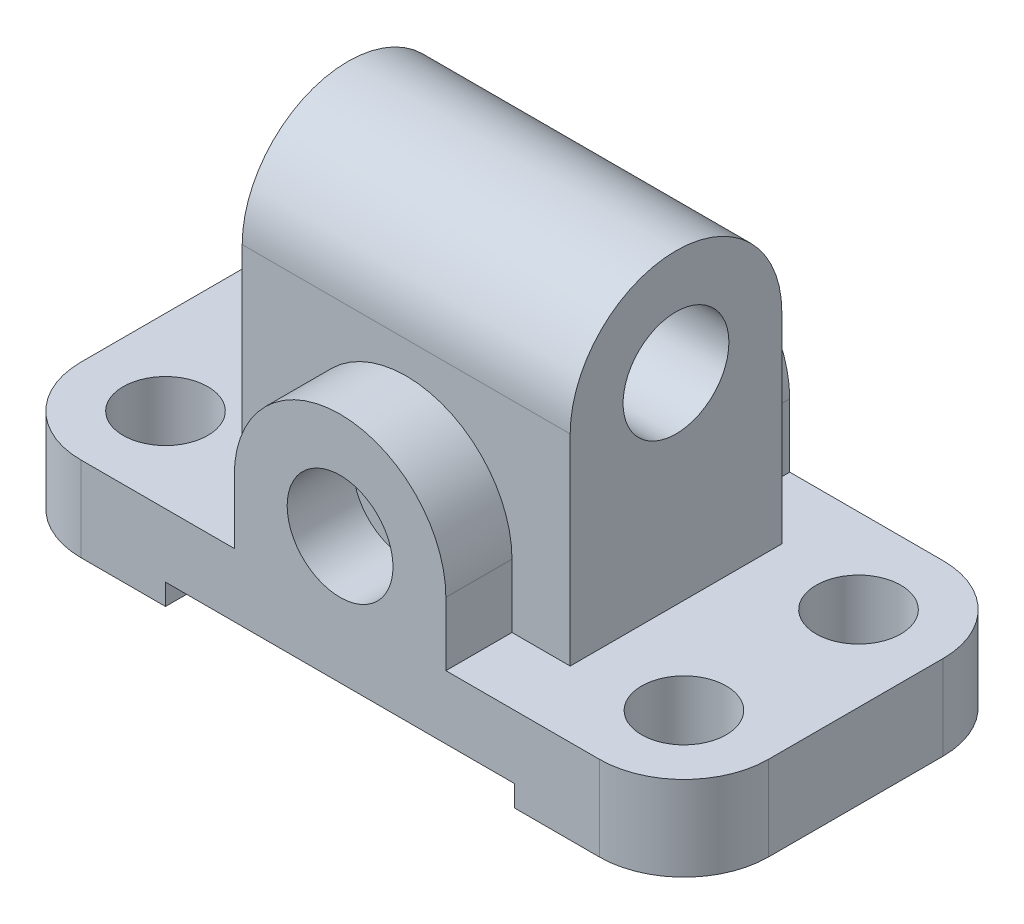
ISO-10303-21;
HEADER;
FILE_DESCRIPTION(('STEP AP214'),'2;1');
FILE_NAME('part.step','',(''),(''),'','','');
FILE_SCHEMA(('AUTOMOTIVE_DESIGN { 1 0 10303 214 1 1 1 1 }'));
ENDSEC;
DATA;
#1=APPLICATION_CONTEXT('core data for automotive mechanical design processes');
#2=APPLICATION_PROTOCOL_DEFINITION('international standard','automotive_design',2000,#1);
#3=PRODUCT_CONTEXT('',#1,'mechanical');
#4=PRODUCT('Part','Part','',(#3));
#5=PRODUCT_RELATED_PRODUCT_CATEGORY('part','',(#4));
#6=PRODUCT_DEFINITION_FORMATION('','',#4);
#7=PRODUCT_DEFINITION_CONTEXT('part definition',#1,'design');
#8=PRODUCT_DEFINITION('design','',#6,#7);
#9=PRODUCT_DEFINITION_SHAPE('','',#8);
#10=(LENGTH_UNIT() NAMED_UNIT(*) SI_UNIT(.MILLI.,.METRE.));
#11=(NAMED_UNIT(*) PLANE_ANGLE_UNIT() SI_UNIT($,.RADIAN.));
#12=(NAMED_UNIT(*) SI_UNIT($,.STERADIAN.) SOLID_ANGLE_UNIT());
#13=UNCERTAINTY_MEASURE_WITH_UNIT(LENGTH_MEASURE(1.E-05),#10,'distance_accuracy_value','');
#14=(GEOMETRIC_REPRESENTATION_CONTEXT(3) GLOBAL_UNCERTAINTY_ASSIGNED_CONTEXT((#13)) GLOBAL_UNIT_ASSIGNED_CONTEXT((#10,
#11,#12)) REPRESENTATION_CONTEXT('',''));
#15=CARTESIAN_POINT('',(0.,0.,0.));
#16=DIRECTION('',(0.,0.,1.));
#17=DIRECTION('',(1.,0.,0.));
#18=AXIS2_PLACEMENT_3D('',#15,#16,#17);
#19=CARTESIAN_POINT('',(-98.,0.,-33.));
#20=DIRECTION('',(0.,1.,0.));
#21=DIRECTION('',(0.,0.,1.));
#22=AXIS2_PLACEMENT_3D('',#19,#20,#21);
#23=PLANE('',#22);
#24=CARTESIAN_POINT('',(-98.,0.,-33.));
#25=DIRECTION('',(0.,1.,0.));
#26=DIRECTION('',(0.,0.,1.));
#27=AXIS2_PLACEMENT_3D('',#24,#25,#26);
#28=CIRCLE('',#27,16.);
#29=CARTESIAN_POINT('',(-98.,0.,-17.));
#30=VERTEX_POINT('',#29);
#31=EDGE_CURVE('E269',#30,#30,#28,.T.);
#32=ORIENTED_EDGE('',*,*,#31,.T.);
#33=EDGE_LOOP('',(#32));
#34=FACE_BOUND('',#33,.T.);
#35=CARTESIAN_POINT('',(-98.,0.,33.));
#36=DIRECTION('',(0.,-1.,0.));
#37=DIRECTION('',(0.,0.,-1.));
#38=AXIS2_PLACEMENT_3D('',#35,#36,#37);
#39=CIRCLE('',#38,16.);
#40=CARTESIAN_POINT('',(-98.,0.,17.));
#41=VERTEX_POINT('',#40);
#42=EDGE_CURVE('E263',#41,#41,#39,.T.);
#43=ORIENTED_EDGE('',*,*,#42,.F.);
#44=EDGE_LOOP('',(#43));
#45=FACE_BOUND('',#44,.T.);
#46=DIRECTION('',(-1.,0.,0.));
#47=VECTOR('',#46,1.);
#48=CARTESIAN_POINT('',(98.,0.,-65.));
#49=LINE('',#48,#47);
#50=CARTESIAN_POINT('',(-66.,0.,-65.));
#51=VERTEX_POINT('',#50);
#52=CARTESIAN_POINT('',(-98.,0.,-65.));
#53=VERTEX_POINT('',#52);
#54=EDGE_CURVE('E383',#51,#53,#49,.T.);
#55=ORIENTED_EDGE('',*,*,#54,.F.);
#56=DIRECTION('',(0.,0.,1.));
#57=VECTOR('',#56,1.);
#58=CARTESIAN_POINT('',(-66.,0.,-33.));
#59=LINE('',#58,#57);
#60=CARTESIAN_POINT('',(-66.,0.,65.));
#61=VERTEX_POINT('',#60);
#62=EDGE_CURVE('E206',#51,#61,#59,.T.);
#63=ORIENTED_EDGE('',*,*,#62,.T.);
#64=DIRECTION('',(1.,0.,0.));
#65=VECTOR('',#64,1.);
#66=CARTESIAN_POINT('',(98.,0.,64.9999999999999));
#67=LINE('',#66,#65);
#68=CARTESIAN_POINT('',(-98.,0.,65.));
#69=VERTEX_POINT('',#68);
#70=EDGE_CURVE('E374',#69,#61,#67,.T.);
#71=ORIENTED_EDGE('',*,*,#70,.F.);
#72=CARTESIAN_POINT('',(-98.,0.,33.));
#73=DIRECTION('',(0.,1.,0.));
#74=DIRECTION('',(0.,0.,-1.));
#75=AXIS2_PLACEMENT_3D('',#72,#73,#74);
#76=CIRCLE('',#75,32.);
#77=CARTESIAN_POINT('',(-130.,0.,33.));
#78=VERTEX_POINT('',#77);
#79=EDGE_CURVE('E371',#78,#69,#76,.T.);
#80=ORIENTED_EDGE('',*,*,#79,.F.);
#81=DIRECTION('',(0.,0.,1.));
#82=VECTOR('',#81,1.);
#83=CARTESIAN_POINT('',(-130.,0.,33.));
#84=LINE('',#83,#82);
#85=CARTESIAN_POINT('',(-130.,0.,-33.));
#86=VERTEX_POINT('',#85);
#87=EDGE_CURVE('E369',#86,#78,#84,.T.);
#88=ORIENTED_EDGE('',*,*,#87,.F.);
#89=CARTESIAN_POINT('',(-98.,0.,-33.));
#90=DIRECTION('',(0.,1.,0.));
#91=DIRECTION('',(0.,0.,1.));
#92=AXIS2_PLACEMENT_3D('',#89,#90,#91);
#93=CIRCLE('',#92,32.);
#94=EDGE_CURVE('E335',#53,#86,#93,.T.);
#95=ORIENTED_EDGE('',*,*,#94,.F.);
#96=EDGE_LOOP('',(#55,#63,#71,#80,#88,#95));
#97=FACE_BOUND('',#96,.T.);
#98=ADVANCED_FACE('F31',(#34,#45,#97),#23,.F.);
#99=CARTESIAN_POINT('',(-98.,32.,-33.));
#100=DIRECTION('',(0.,1.,0.));
#101=DIRECTION('',(0.,0.,1.));
#102=AXIS2_PLACEMENT_3D('',#99,#100,#101);
#103=PLANE('',#102);
#104=CARTESIAN_POINT('',(98.,32.,-33.));
#105=DIRECTION('',(0.,-1.,0.));
#106=DIRECTION('',(0.,0.,1.));
#107=AXIS2_PLACEMENT_3D('',#104,#105,#106);
#108=CIRCLE('',#107,16.);
#109=CARTESIAN_POINT('',(98.,32.,-17.));
#110=VERTEX_POINT('',#109);
#111=EDGE_CURVE('E250',#110,#110,#108,.T.);
#112=ORIENTED_EDGE('',*,*,#111,.T.);
#113=EDGE_LOOP('',(#112));
#114=FACE_BOUND('',#113,.T.);
#115=CARTESIAN_POINT('',(98.,32.,33.));
#116=DIRECTION('',(0.,1.,0.));
#117=DIRECTION('',(0.,0.,-1.));
#118=AXIS2_PLACEMENT_3D('',#115,#116,#117);
#119=CIRCLE('',#118,16.);
#120=CARTESIAN_POINT('',(98.,32.,17.));
#121=VERTEX_POINT('',#120);
#122=EDGE_CURVE('E254',#121,#121,#119,.T.);
#123=ORIENTED_EDGE('',*,*,#122,.F.);
#124=EDGE_LOOP('',(#123));
#125=FACE_BOUND('',#124,.T.);
#126=DIRECTION('',(1.,0.,0.));
#127=VECTOR('',#126,1.);
#128=CARTESIAN_POINT('',(-62.,32.,40.));
#129=LINE('',#128,#127);
#130=CARTESIAN_POINT('',(40.,32.,40.));
#131=VERTEX_POINT('',#130);
#132=CARTESIAN_POINT('',(62.,32.,40.));
#133=VERTEX_POINT('',#132);
#134=EDGE_CURVE('E340',#131,#133,#129,.T.);
#135=ORIENTED_EDGE('',*,*,#134,.F.);
#136=DIRECTION('',(0.,0.,-1.));
#137=VECTOR('',#136,1.);
#138=CARTESIAN_POINT('',(40.,32.,167.449987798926));
#139=LINE('',#138,#137);
#140=CARTESIAN_POINT('',(40.,32.,65.));
#141=VERTEX_POINT('',#140);
#142=EDGE_CURVE('E236',#141,#131,#139,.T.);
#143=ORIENTED_EDGE('',*,*,#142,.F.);
#144=DIRECTION('',(1.,0.,0.));
#145=VECTOR('',#144,1.);
#146=CARTESIAN_POINT('',(98.,32.,64.9999999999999));
#147=LINE('',#146,#145);
#148=CARTESIAN_POINT('',(98.,32.,64.9999999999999));
#149=VERTEX_POINT('',#148);
#150=EDGE_CURVE('E352',#141,#149,#147,.T.);
#151=ORIENTED_EDGE('',*,*,#150,.T.);
#152=CARTESIAN_POINT('',(98.,32.,33.));
#153=DIRECTION('',(0.,1.,0.));
#154=DIRECTION('',(0.,0.,1.));
#155=AXIS2_PLACEMENT_3D('',#152,#153,#154);
#156=CIRCLE('',#155,32.);
#157=CARTESIAN_POINT('',(130.,32.,33.));
#158=VERTEX_POINT('',#157);
#159=EDGE_CURVE('E356',#149,#158,#156,.T.);
#160=ORIENTED_EDGE('',*,*,#159,.T.);
#161=DIRECTION('',(0.,0.,-1.));
#162=VECTOR('',#161,1.);
#163=CARTESIAN_POINT('',(130.,32.,33.));
#164=LINE('',#163,#162);
#165=CARTESIAN_POINT('',(130.,32.,-33.));
#166=VERTEX_POINT('',#165);
#167=EDGE_CURVE('E358',#158,#166,#164,.T.);
#168=ORIENTED_EDGE('',*,*,#167,.T.);
#169=CARTESIAN_POINT('',(98.,32.,-33.));
#170=DIRECTION('',(0.,1.,0.));
#171=DIRECTION('',(0.,0.,1.));
#172=AXIS2_PLACEMENT_3D('',#169,#170,#171);
#173=CIRCLE('',#172,32.);
#174=CARTESIAN_POINT('',(98.,32.,-65.));
#175=VERTEX_POINT('',#174);
#176=EDGE_CURVE('E360',#166,#175,#173,.T.);
#177=ORIENTED_EDGE('',*,*,#176,.T.);
#178=DIRECTION('',(-1.,0.,0.));
#179=VECTOR('',#178,1.);
#180=CARTESIAN_POINT('',(98.,32.,-65.));
#181=LINE('',#180,#179);
#182=CARTESIAN_POINT('',(40.,32.,-65.));
#183=VERTEX_POINT('',#182);
#184=EDGE_CURVE('E363',#175,#183,#181,.T.);
#185=ORIENTED_EDGE('',*,*,#184,.T.);
#186=DIRECTION('',(0.,0.,1.));
#187=VECTOR('',#186,1.);
#188=CARTESIAN_POINT('',(40.,32.,-167.449987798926));
#189=LINE('',#188,#187);
#190=CARTESIAN_POINT('',(40.,32.,-40.));
#191=VERTEX_POINT('',#190);
#192=EDGE_CURVE('E272',#183,#191,#189,.T.);
#193=ORIENTED_EDGE('',*,*,#192,.T.);
#194=DIRECTION('',(1.,0.,0.));
#195=VECTOR('',#194,1.);
#196=CARTESIAN_POINT('',(-62.,32.,-40.));
#197=LINE('',#196,#195);
#198=CARTESIAN_POINT('',(62.,32.,-40.));
#199=VERTEX_POINT('',#198);
#200=EDGE_CURVE('E336',#191,#199,#197,.T.);
#201=ORIENTED_EDGE('',*,*,#200,.T.);
#202=DIRECTION('',(0.,0.,-1.));
#203=VECTOR('',#202,1.);
#204=CARTESIAN_POINT('',(62.,32.,-40.));
#205=LINE('',#204,#203);
#206=EDGE_CURVE('E314',#133,#199,#205,.T.);
#207=ORIENTED_EDGE('',*,*,#206,.F.);
#208=EDGE_LOOP('',(#135,#143,#151,#160,#168,#177,#185,#193,#201,#207));
#209=FACE_BOUND('',#208,.T.);
#210=ADVANCED_FACE('F435',(#114,#125,#209),#103,.T.);
#211=CARTESIAN_POINT('',(-98.,32.,-33.));
#212=DIRECTION('',(0.,1.,0.));
#213=DIRECTION('',(0.,0.,1.));
#214=AXIS2_PLACEMENT_3D('',#211,#212,#213);
#215=CIRCLE('',#214,16.);
#216=CARTESIAN_POINT('',(-98.,32.,-17.));
#217=VERTEX_POINT('',#216);
#218=EDGE_CURVE('E266',#217,#217,#215,.T.);
#219=ORIENTED_EDGE('',*,*,#218,.F.);
#220=EDGE_LOOP('',(#219));
#221=FACE_BOUND('',#220,.T.);
#222=CARTESIAN_POINT('',(-98.,32.,33.));
#223=DIRECTION('',(0.,-1.,0.));
#224=DIRECTION('',(0.,0.,-1.));
#225=AXIS2_PLACEMENT_3D('',#222,#223,#224);
#226=CIRCLE('',#225,16.);
#227=CARTESIAN_POINT('',(-98.,32.,17.));
#228=VERTEX_POINT('',#227);
#229=EDGE_CURVE('E260',#228,#228,#226,.T.);
#230=ORIENTED_EDGE('',*,*,#229,.T.);
#231=EDGE_LOOP('',(#230));
#232=FACE_BOUND('',#231,.T.);
#233=CARTESIAN_POINT('',(-98.,32.,65.));
#234=VERTEX_POINT('',#233);
#235=CARTESIAN_POINT('',(-40.,32.,65.));
#236=VERTEX_POINT('',#235);
#237=EDGE_CURVE('E353',#234,#236,#147,.T.);
#238=ORIENTED_EDGE('',*,*,#237,.T.);
#239=DIRECTION('',(0.,0.,-1.));
#240=VECTOR('',#239,1.);
#241=CARTESIAN_POINT('',(-40.,32.,167.449987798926));
#242=LINE('',#241,#240);
#243=CARTESIAN_POINT('',(-40.,32.,40.));
#244=VERTEX_POINT('',#243);
#245=EDGE_CURVE('E224',#236,#244,#242,.T.);
#246=ORIENTED_EDGE('',*,*,#245,.T.);
#247=CARTESIAN_POINT('',(-62.,32.,40.));
#248=VERTEX_POINT('',#247);
#249=EDGE_CURVE('E337',#248,#244,#129,.T.);
#250=ORIENTED_EDGE('',*,*,#249,.F.);
#251=DIRECTION('',(0.,0.,-1.));
#252=VECTOR('',#251,1.);
#253=CARTESIAN_POINT('',(-62.,32.,-40.));
#254=LINE('',#253,#252);
#255=CARTESIAN_POINT('',(-62.,32.,-40.));
#256=VERTEX_POINT('',#255);
#257=EDGE_CURVE('E328',#248,#256,#254,.T.);
#258=ORIENTED_EDGE('',*,*,#257,.T.);
#259=CARTESIAN_POINT('',(-40.,32.,-40.));
#260=VERTEX_POINT('',#259);
#261=EDGE_CURVE('E332',#256,#260,#197,.T.);
#262=ORIENTED_EDGE('',*,*,#261,.T.);
#263=DIRECTION('',(0.,0.,1.));
#264=VECTOR('',#263,1.);
#265=CARTESIAN_POINT('',(-40.,32.,-167.449987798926));
#266=LINE('',#265,#264);
#267=CARTESIAN_POINT('',(-40.,32.,-65.));
#268=VERTEX_POINT('',#267);
#269=EDGE_CURVE('E287',#268,#260,#266,.T.);
#270=ORIENTED_EDGE('',*,*,#269,.F.);
#271=CARTESIAN_POINT('',(-98.,32.,-65.));
#272=VERTEX_POINT('',#271);
#273=EDGE_CURVE('E362',#268,#272,#181,.T.);
#274=ORIENTED_EDGE('',*,*,#273,.T.);
#275=CARTESIAN_POINT('',(-98.,32.,-33.));
#276=DIRECTION('',(0.,1.,0.));
#277=DIRECTION('',(0.,0.,1.));
#278=AXIS2_PLACEMENT_3D('',#275,#276,#277);
#279=CIRCLE('',#278,32.);
#280=CARTESIAN_POINT('',(-130.,32.,-33.));
#281=VERTEX_POINT('',#280);
#282=EDGE_CURVE('E344',#272,#281,#279,.T.);
#283=ORIENTED_EDGE('',*,*,#282,.T.);
#284=DIRECTION('',(0.,0.,1.));
#285=VECTOR('',#284,1.);
#286=CARTESIAN_POINT('',(-130.,32.,33.));
#287=LINE('',#286,#285);
#288=CARTESIAN_POINT('',(-130.,32.,33.));
#289=VERTEX_POINT('',#288);
#290=EDGE_CURVE('E347',#281,#289,#287,.T.);
#291=ORIENTED_EDGE('',*,*,#290,.T.);
#292=CARTESIAN_POINT('',(-98.,32.,33.));
#293=DIRECTION('',(0.,1.,0.));
#294=DIRECTION('',(0.,0.,-1.));
#295=AXIS2_PLACEMENT_3D('',#292,#293,#294);
#296=CIRCLE('',#295,32.);
#297=EDGE_CURVE('E350',#289,#234,#296,.T.);
#298=ORIENTED_EDGE('',*,*,#297,.T.);
#299=EDGE_LOOP('',(#238,#246,#250,#258,#262,#270,#274,#283,#291,#298));
#300=FACE_BOUND('',#299,.T.);
#301=ADVANCED_FACE('F432',(#221,#232,#300),#103,.T.);
#302=CARTESIAN_POINT('',(-62.,32.,40.));
#303=DIRECTION('',(0.,0.,1.));
#304=DIRECTION('',(0.,-1.,0.));
#305=AXIS2_PLACEMENT_3D('',#302,#303,#304);
#306=PLANE('',#305);
#307=CARTESIAN_POINT('',(0.,56.,40.));
#308=DIRECTION('',(0.,0.,1.));
#309=DIRECTION('',(-1.,0.,0.));
#310=AXIS2_PLACEMENT_3D('',#307,#308,#309);
#311=CIRCLE('',#310,40.);
#312=CARTESIAN_POINT('',(40.,56.,40.));
#313=VERTEX_POINT('',#312);
#314=CARTESIAN_POINT('',(-40.,56.,40.));
#315=VERTEX_POINT('',#314);
#316=EDGE_CURVE('E54',#313,#315,#311,.T.);
#317=ORIENTED_EDGE('',*,*,#316,.F.);
#318=DIRECTION('',(0.,1.,0.));
#319=VECTOR('',#318,1.);
#320=CARTESIAN_POINT('',(40.,56.,40.));
#321=LINE('',#320,#319);
#322=EDGE_CURVE('E232',#131,#313,#321,.T.);
#323=ORIENTED_EDGE('',*,*,#322,.F.);
#324=ORIENTED_EDGE('',*,*,#134,.T.);
#325=DIRECTION('',(0.,-1.,0.));
#326=VECTOR('',#325,1.);
#327=CARTESIAN_POINT('',(62.,32.,40.));
#328=LINE('',#327,#326);
#329=CARTESIAN_POINT('',(62.,108.,40.));
#330=VERTEX_POINT('',#329);
#331=EDGE_CURVE('E311',#330,#133,#328,.T.);
#332=ORIENTED_EDGE('',*,*,#331,.F.);
#333=DIRECTION('',(1.,0.,0.));
#334=VECTOR('',#333,1.);
#335=CARTESIAN_POINT('',(-62.,108.,40.));
#336=LINE('',#335,#334);
#337=CARTESIAN_POINT('',(-62.,108.,40.));
#338=VERTEX_POINT('',#337);
#339=EDGE_CURVE('E341',#338,#330,#336,.T.);
#340=ORIENTED_EDGE('',*,*,#339,.F.);
#341=DIRECTION('',(0.,-1.,0.));
#342=VECTOR('',#341,1.);
#343=CARTESIAN_POINT('',(-62.,32.,40.));
#344=LINE('',#343,#342);
#345=EDGE_CURVE('E326',#338,#248,#344,.T.);
#346=ORIENTED_EDGE('',*,*,#345,.T.);
#347=ORIENTED_EDGE('',*,*,#249,.T.);
#348=DIRECTION('',(0.,-1.,0.));
#349=VECTOR('',#348,1.);
#350=CARTESIAN_POINT('',(-40.,32.,40.));
#351=LINE('',#350,#349);
#352=EDGE_CURVE('E225',#315,#244,#351,.T.);
#353=ORIENTED_EDGE('',*,*,#352,.F.);
#354=EDGE_LOOP('',(#317,#323,#324,#332,#340,#346,#347,#353));
#355=FACE_BOUND('',#354,.T.);
#356=ADVANCED_FACE('F418',(#355),#306,.T.);
#357=CARTESIAN_POINT('',(66.,0.,65.));
#358=VERTEX_POINT('',#357);
#359=CARTESIAN_POINT('',(98.,0.,64.9999999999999));
#360=VERTEX_POINT('',#359);
#361=EDGE_CURVE('E373',#358,#360,#67,.T.);
#362=ORIENTED_EDGE('',*,*,#361,.F.);
#363=DIRECTION('',(0.,0.,-1.));
#364=VECTOR('',#363,1.);
#365=CARTESIAN_POINT('',(66.,0.,-33.));
#366=LINE('',#365,#364);
#367=CARTESIAN_POINT('',(66.,0.,-65.));
#368=VERTEX_POINT('',#367);
#369=EDGE_CURVE('E199',#358,#368,#366,.T.);
#370=ORIENTED_EDGE('',*,*,#369,.T.);
#371=CARTESIAN_POINT('',(98.,0.,-65.));
#372=VERTEX_POINT('',#371);
#373=EDGE_CURVE('E348',#372,#368,#49,.T.);
#374=ORIENTED_EDGE('',*,*,#373,.F.);
#375=CARTESIAN_POINT('',(98.,0.,-33.));
#376=DIRECTION('',(0.,1.,0.));
#377=DIRECTION('',(0.,0.,1.));
#378=AXIS2_PLACEMENT_3D('',#375,#376,#377);
#379=CIRCLE('',#378,32.);
#380=CARTESIAN_POINT('',(130.,0.,-33.));
#381=VERTEX_POINT('',#380);
#382=EDGE_CURVE('E381',#381,#372,#379,.T.);
#383=ORIENTED_EDGE('',*,*,#382,.F.);
#384=DIRECTION('',(0.,0.,-1.));
#385=VECTOR('',#384,1.);
#386=CARTESIAN_POINT('',(130.,0.,33.));
#387=LINE('',#386,#385);
#388=CARTESIAN_POINT('',(130.,0.,33.));
#389=VERTEX_POINT('',#388);
#390=EDGE_CURVE('E379',#389,#381,#387,.T.);
#391=ORIENTED_EDGE('',*,*,#390,.F.);
#392=CARTESIAN_POINT('',(98.,0.,33.));
#393=DIRECTION('',(0.,1.,0.));
#394=DIRECTION('',(0.,0.,1.));
#395=AXIS2_PLACEMENT_3D('',#392,#393,#394);
#396=CIRCLE('',#395,32.);
#397=EDGE_CURVE('E377',#360,#389,#396,.T.);
#398=ORIENTED_EDGE('',*,*,#397,.F.);
#399=EDGE_LOOP('',(#362,#370,#374,#383,#391,#398));
#400=FACE_BOUND('',#399,.T.);
#401=CARTESIAN_POINT('',(98.,0.,33.));
#402=DIRECTION('',(0.,1.,0.));
#403=DIRECTION('',(0.,0.,-1.));
#404=AXIS2_PLACEMENT_3D('',#401,#402,#403);
#405=CIRCLE('',#404,16.);
#406=CARTESIAN_POINT('',(98.,0.,17.));
#407=VERTEX_POINT('',#406);
#408=EDGE_CURVE('E257',#407,#407,#405,.T.);
#409=ORIENTED_EDGE('',*,*,#408,.T.);
#410=EDGE_LOOP('',(#409));
#411=FACE_BOUND('',#410,.T.);
#412=CARTESIAN_POINT('',(98.,0.,-33.));
#413=DIRECTION('',(0.,-1.,0.));
#414=DIRECTION('',(0.,0.,1.));
#415=AXIS2_PLACEMENT_3D('',#412,#413,#414);
#416=CIRCLE('',#415,16.);
#417=CARTESIAN_POINT('',(98.,0.,-17.));
#418=VERTEX_POINT('',#417);
#419=EDGE_CURVE('E251',#418,#418,#416,.T.);
#420=ORIENTED_EDGE('',*,*,#419,.F.);
#421=EDGE_LOOP('',(#420));
#422=FACE_BOUND('',#421,.T.);
#423=ADVANCED_FACE('F431',(#400,#411,#422),#23,.F.);
#424=CARTESIAN_POINT('',(-62.,108.,-40.));
#425=DIRECTION('',(0.,0.,-1.));
#426=DIRECTION('',(0.,1.,0.));
#427=AXIS2_PLACEMENT_3D('',#424,#425,#426);
#428=PLANE('',#427);
#429=CARTESIAN_POINT('',(0.,56.,-40.));
#430=DIRECTION('',(0.,0.,-1.));
#431=DIRECTION('',(0.,-1.,0.));
#432=AXIS2_PLACEMENT_3D('',#429,#430,#431);
#433=CIRCLE('',#432,40.);
#434=CARTESIAN_POINT('',(-40.,56.,-40.));
#435=VERTEX_POINT('',#434);
#436=CARTESIAN_POINT('',(40.,56.,-40.));
#437=VERTEX_POINT('',#436);
#438=EDGE_CURVE('E279',#435,#437,#433,.T.);
#439=ORIENTED_EDGE('',*,*,#438,.F.);
#440=DIRECTION('',(0.,1.,0.));
#441=VECTOR('',#440,1.);
#442=CARTESIAN_POINT('',(-40.,56.,-40.));
#443=LINE('',#442,#441);
#444=EDGE_CURVE('E283',#260,#435,#443,.T.);
#445=ORIENTED_EDGE('',*,*,#444,.F.);
#446=ORIENTED_EDGE('',*,*,#261,.F.);
#447=DIRECTION('',(0.,1.,0.));
#448=VECTOR('',#447,1.);
#449=CARTESIAN_POINT('',(-62.,108.,-40.));
#450=LINE('',#449,#448);
#451=CARTESIAN_POINT('',(-62.,108.,-40.));
#452=VERTEX_POINT('',#451);
#453=EDGE_CURVE('E320',#256,#452,#450,.T.);
#454=ORIENTED_EDGE('',*,*,#453,.T.);
#455=DIRECTION('',(1.,0.,0.));
#456=VECTOR('',#455,1.);
#457=CARTESIAN_POINT('',(-62.,108.,-40.));
#458=LINE('',#457,#456);
#459=CARTESIAN_POINT('',(62.,108.,-40.));
#460=VERTEX_POINT('',#459);
#461=EDGE_CURVE('E331',#452,#460,#458,.T.);
#462=ORIENTED_EDGE('',*,*,#461,.T.);
#463=DIRECTION('',(0.,1.,0.));
#464=VECTOR('',#463,1.);
#465=CARTESIAN_POINT('',(62.,108.,-40.));
#466=LINE('',#465,#464);
#467=EDGE_CURVE('E305',#199,#460,#466,.T.);
#468=ORIENTED_EDGE('',*,*,#467,.F.);
#469=ORIENTED_EDGE('',*,*,#200,.F.);
#470=DIRECTION('',(0.,-1.,0.));
#471=VECTOR('',#470,1.);
#472=CARTESIAN_POINT('',(40.,32.,-40.));
#473=LINE('',#472,#471);
#474=EDGE_CURVE('E275',#437,#191,#473,.T.);
#475=ORIENTED_EDGE('',*,*,#474,.F.);
#476=EDGE_LOOP('',(#439,#445,#446,#454,#462,#468,#469,#475));
#477=FACE_BOUND('',#476,.T.);
#478=ADVANCED_FACE('F446',(#477),#428,.T.);
#479=CARTESIAN_POINT('',(-98.,32.,-33.));
#480=DIRECTION('',(0.,-1.,0.));
#481=DIRECTION('',(0.,0.,-1.));
#482=AXIS2_PLACEMENT_3D('',#479,#480,#481);
#483=CYLINDRICAL_SURFACE('',#482,32.);
#484=ORIENTED_EDGE('',*,*,#94,.T.);
#485=DIRECTION('',(0.,-1.,0.));
#486=VECTOR('',#485,1.);
#487=CARTESIAN_POINT('',(-130.,32.,-33.));
#488=LINE('',#487,#486);
#489=EDGE_CURVE('E405',#281,#86,#488,.T.);
#490=ORIENTED_EDGE('',*,*,#489,.F.);
#491=ORIENTED_EDGE('',*,*,#282,.F.);
#492=DIRECTION('',(0.,-1.,0.));
#493=VECTOR('',#492,1.);
#494=CARTESIAN_POINT('',(-98.,32.,-65.));
#495=LINE('',#494,#493);
#496=EDGE_CURVE('E366',#272,#53,#495,.T.);
#497=ORIENTED_EDGE('',*,*,#496,.T.);
#498=EDGE_LOOP('',(#484,#490,#491,#497));
#499=FACE_BOUND('',#498,.T.);
#500=ADVANCED_FACE('F33',(#499),#483,.T.);
#501=CARTESIAN_POINT('',(-130.,32.,33.));
#502=DIRECTION('',(1.,0.,0.));
#503=DIRECTION('',(0.,0.,-1.));
#504=AXIS2_PLACEMENT_3D('',#501,#502,#503);
#505=PLANE('',#504);
#506=ORIENTED_EDGE('',*,*,#87,.T.);
#507=DIRECTION('',(0.,-1.,0.));
#508=VECTOR('',#507,1.);
#509=CARTESIAN_POINT('',(-130.,32.,33.));
#510=LINE('',#509,#508);
#511=EDGE_CURVE('E402',#289,#78,#510,.T.);
#512=ORIENTED_EDGE('',*,*,#511,.F.);
#513=ORIENTED_EDGE('',*,*,#290,.F.);
#514=ORIENTED_EDGE('',*,*,#489,.T.);
#515=EDGE_LOOP('',(#506,#512,#513,#514));
#516=FACE_BOUND('',#515,.T.);
#517=ADVANCED_FACE('F725',(#516),#505,.F.);
#518=CARTESIAN_POINT('',(-98.,32.,33.));
#519=DIRECTION('',(0.,-1.,0.));
#520=DIRECTION('',(0.,0.,-1.));
#521=AXIS2_PLACEMENT_3D('',#518,#519,#520);
#522=CYLINDRICAL_SURFACE('',#521,32.);
#523=ORIENTED_EDGE('',*,*,#79,.T.);
#524=DIRECTION('',(0.,-1.,0.));
#525=VECTOR('',#524,1.);
#526=CARTESIAN_POINT('',(-98.,32.,65.));
#527=LINE('',#526,#525);
#528=EDGE_CURVE('E399',#234,#69,#527,.T.);
#529=ORIENTED_EDGE('',*,*,#528,.F.);
#530=ORIENTED_EDGE('',*,*,#297,.F.);
#531=ORIENTED_EDGE('',*,*,#511,.T.);
#532=EDGE_LOOP('',(#523,#529,#530,#531));
#533=FACE_BOUND('',#532,.T.);
#534=ADVANCED_FACE('F646',(#533),#522,.T.);
#535=CARTESIAN_POINT('',(98.,32.,64.9999999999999));
#536=DIRECTION('',(0.,0.,-1.));
#537=DIRECTION('',(-1.,0.,0.));
#538=AXIS2_PLACEMENT_3D('',#535,#536,#537);
#539=PLANE('',#538);
#540=ORIENTED_EDGE('',*,*,#70,.T.);
#541=DIRECTION('',(0.,-1.,0.));
#542=VECTOR('',#541,1.);
#543=CARTESIAN_POINT('',(-66.,8.,65.));
#544=LINE('',#543,#542);
#545=CARTESIAN_POINT('',(-66.,8.,65.));
#546=VERTEX_POINT('',#545);
#547=EDGE_CURVE('E216',#546,#61,#544,.T.);
#548=ORIENTED_EDGE('',*,*,#547,.F.);
#549=DIRECTION('',(-1.,0.,0.));
#550=VECTOR('',#549,1.);
#551=CARTESIAN_POINT('',(-66.,8.,65.));
#552=LINE('',#551,#550);
#553=CARTESIAN_POINT('',(66.,8.00000000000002,65.));
#554=VERTEX_POINT('',#553);
#555=EDGE_CURVE('E196',#554,#546,#552,.T.);
#556=ORIENTED_EDGE('',*,*,#555,.F.);
#557=DIRECTION('',(0.,1.,0.));
#558=VECTOR('',#557,1.);
#559=CARTESIAN_POINT('',(66.,8.00000000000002,65.));
#560=LINE('',#559,#558);
#561=EDGE_CURVE('E218',#358,#554,#560,.T.);
#562=ORIENTED_EDGE('',*,*,#561,.F.);
#563=ORIENTED_EDGE('',*,*,#361,.T.);
#564=DIRECTION('',(0.,-1.,0.));
#565=VECTOR('',#564,1.);
#566=CARTESIAN_POINT('',(98.,32.,64.9999999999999));
#567=LINE('',#566,#565);
#568=EDGE_CURVE('E396',#149,#360,#567,.T.);
#569=ORIENTED_EDGE('',*,*,#568,.F.);
#570=ORIENTED_EDGE('',*,*,#150,.F.);
#571=DIRECTION('',(0.,-1.,0.));
#572=VECTOR('',#571,1.);
#573=CARTESIAN_POINT('',(40.,56.,65.));
#574=LINE('',#573,#572);
#575=CARTESIAN_POINT('',(40.,56.,65.));
#576=VERTEX_POINT('',#575);
#577=EDGE_CURVE('E238',#576,#141,#574,.T.);
#578=ORIENTED_EDGE('',*,*,#577,.F.);
#579=CARTESIAN_POINT('',(0.,56.,65.));
#580=DIRECTION('',(0.,0.,-1.));
#581=DIRECTION('',(-1.,0.,0.));
#582=AXIS2_PLACEMENT_3D('',#579,#580,#581);
#583=CIRCLE('',#582,40.);
#584=CARTESIAN_POINT('',(-40.,56.,65.));
#585=VERTEX_POINT('',#584);
#586=EDGE_CURVE('E235',#585,#576,#583,.T.);
#587=ORIENTED_EDGE('',*,*,#586,.F.);
#588=DIRECTION('',(0.,1.,0.));
#589=VECTOR('',#588,1.);
#590=CARTESIAN_POINT('',(-40.,32.,65.));
#591=LINE('',#590,#589);
#592=EDGE_CURVE('E230',#236,#585,#591,.T.);
#593=ORIENTED_EDGE('',*,*,#592,.F.);
#594=ORIENTED_EDGE('',*,*,#237,.F.);
#595=ORIENTED_EDGE('',*,*,#528,.T.);
#596=EDGE_LOOP('',(#540,#548,#556,#562,#563,#569,#570,#578,#587,#593,#594,#595));
#597=FACE_BOUND('',#596,.T.);
#598=CARTESIAN_POINT('',(0.,56.,65.));
#599=DIRECTION('',(0.,0.,-1.));
#600=DIRECTION('',(-1.,0.,0.));
#601=AXIS2_PLACEMENT_3D('',#598,#599,#600);
#602=CIRCLE('',#601,20.);
#603=CARTESIAN_POINT('',(-20.,56.,65.));
#604=VERTEX_POINT('',#603);
#605=EDGE_CURVE('E227',#604,#604,#602,.T.);
#606=ORIENTED_EDGE('',*,*,#605,.T.);
#607=EDGE_LOOP('',(#606));
#608=FACE_BOUND('',#607,.T.);
#609=ADVANCED_FACE('F498',(#597,#608),#539,.F.);
#610=CARTESIAN_POINT('',(98.,32.,33.));
#611=DIRECTION('',(0.,-1.,0.));
#612=DIRECTION('',(0.,0.,-1.));
#613=AXIS2_PLACEMENT_3D('',#610,#611,#612);
#614=CYLINDRICAL_SURFACE('',#613,32.);
#615=ORIENTED_EDGE('',*,*,#397,.T.);
#616=DIRECTION('',(0.,-1.,0.));
#617=VECTOR('',#616,1.);
#618=CARTESIAN_POINT('',(130.,32.,33.));
#619=LINE('',#618,#617);
#620=EDGE_CURVE('E393',#158,#389,#619,.T.);
#621=ORIENTED_EDGE('',*,*,#620,.F.);
#622=ORIENTED_EDGE('',*,*,#159,.F.);
#623=ORIENTED_EDGE('',*,*,#568,.T.);
#624=EDGE_LOOP('',(#615,#621,#622,#623));
#625=FACE_BOUND('',#624,.T.);
#626=ADVANCED_FACE('F645',(#625),#614,.T.);
#627=CARTESIAN_POINT('',(130.,32.,33.));
#628=DIRECTION('',(-1.,0.,0.));
#629=DIRECTION('',(0.,0.,1.));
#630=AXIS2_PLACEMENT_3D('',#627,#628,#629);
#631=PLANE('',#630);
#632=ORIENTED_EDGE('',*,*,#390,.T.);
#633=DIRECTION('',(0.,-1.,0.));
#634=VECTOR('',#633,1.);
#635=CARTESIAN_POINT('',(130.,32.,-33.));
#636=LINE('',#635,#634);
#637=EDGE_CURVE('E390',#166,#381,#636,.T.);
#638=ORIENTED_EDGE('',*,*,#637,.F.);
#639=ORIENTED_EDGE('',*,*,#167,.F.);
#640=ORIENTED_EDGE('',*,*,#620,.T.);
#641=EDGE_LOOP('',(#632,#638,#639,#640));
#642=FACE_BOUND('',#641,.T.);
#643=ADVANCED_FACE('F714',(#642),#631,.F.);
#644=CARTESIAN_POINT('',(98.,32.,-33.));
#645=DIRECTION('',(0.,-1.,0.));
#646=DIRECTION('',(0.,0.,-1.));
#647=AXIS2_PLACEMENT_3D('',#644,#645,#646);
#648=CYLINDRICAL_SURFACE('',#647,32.);
#649=ORIENTED_EDGE('',*,*,#382,.T.);
#650=DIRECTION('',(0.,-1.,0.));
#651=VECTOR('',#650,1.);
#652=CARTESIAN_POINT('',(98.,32.,-65.));
#653=LINE('',#652,#651);
#654=EDGE_CURVE('E387',#175,#372,#653,.T.);
#655=ORIENTED_EDGE('',*,*,#654,.F.);
#656=ORIENTED_EDGE('',*,*,#176,.F.);
#657=ORIENTED_EDGE('',*,*,#637,.T.);
#658=EDGE_LOOP('',(#649,#655,#656,#657));
#659=FACE_BOUND('',#658,.T.);
#660=ADVANCED_FACE('F554',(#659),#648,.T.);
#661=CARTESIAN_POINT('',(98.,32.,-65.));
#662=DIRECTION('',(0.,0.,1.));
#663=DIRECTION('',(1.,0.,0.));
#664=AXIS2_PLACEMENT_3D('',#661,#662,#663);
#665=PLANE('',#664);
#666=DIRECTION('',(-1.,0.,0.));
#667=VECTOR('',#666,1.);
#668=CARTESIAN_POINT('',(-66.,8.,-65.));
#669=LINE('',#668,#667);
#670=CARTESIAN_POINT('',(66.,8.00000000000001,-65.));
#671=VERTEX_POINT('',#670);
#672=CARTESIAN_POINT('',(-66.,8.,-65.));
#673=VERTEX_POINT('',#672);
#674=EDGE_CURVE('E46',#671,#673,#669,.T.);
#675=ORIENTED_EDGE('',*,*,#674,.T.);
#676=DIRECTION('',(0.,-1.,0.));
#677=VECTOR('',#676,1.);
#678=CARTESIAN_POINT('',(-66.,8.,-65.));
#679=LINE('',#678,#677);
#680=EDGE_CURVE('E203',#673,#51,#679,.T.);
#681=ORIENTED_EDGE('',*,*,#680,.T.);
#682=ORIENTED_EDGE('',*,*,#54,.T.);
#683=ORIENTED_EDGE('',*,*,#496,.F.);
#684=ORIENTED_EDGE('',*,*,#273,.F.);
#685=DIRECTION('',(0.,-1.,0.));
#686=VECTOR('',#685,1.);
#687=CARTESIAN_POINT('',(-40.,56.,-65.));
#688=LINE('',#687,#686);
#689=CARTESIAN_POINT('',(-40.,56.,-65.));
#690=VERTEX_POINT('',#689);
#691=EDGE_CURVE('E289',#690,#268,#688,.T.);
#692=ORIENTED_EDGE('',*,*,#691,.F.);
#693=CARTESIAN_POINT('',(0.,56.,-65.));
#694=DIRECTION('',(0.,0.,1.));
#695=DIRECTION('',(1.,0.,0.));
#696=AXIS2_PLACEMENT_3D('',#693,#694,#695);
#697=CIRCLE('',#696,40.);
#698=CARTESIAN_POINT('',(40.,56.,-65.));
#699=VERTEX_POINT('',#698);
#700=EDGE_CURVE('E286',#699,#690,#697,.T.);
#701=ORIENTED_EDGE('',*,*,#700,.F.);
#702=DIRECTION('',(0.,1.,0.));
#703=VECTOR('',#702,1.);
#704=CARTESIAN_POINT('',(40.,32.,-65.));
#705=LINE('',#704,#703);
#706=EDGE_CURVE('E281',#183,#699,#705,.T.);
#707=ORIENTED_EDGE('',*,*,#706,.F.);
#708=ORIENTED_EDGE('',*,*,#184,.F.);
#709=ORIENTED_EDGE('',*,*,#654,.T.);
#710=ORIENTED_EDGE('',*,*,#373,.T.);
#711=DIRECTION('',(0.,1.,0.));
#712=VECTOR('',#711,1.);
#713=CARTESIAN_POINT('',(66.,32.,-65.));
#714=LINE('',#713,#712);
#715=EDGE_CURVE('E11',#368,#671,#714,.T.);
#716=ORIENTED_EDGE('',*,*,#715,.T.);
#717=EDGE_LOOP('',(#675,#681,#682,#683,#684,#692,#701,#707,#708,#709,#710,#716));
#718=FACE_BOUND('',#717,.T.);
#719=CARTESIAN_POINT('',(0.,56.,-65.));
#720=DIRECTION('',(0.,0.,1.));
#721=DIRECTION('',(1.,0.,0.));
#722=AXIS2_PLACEMENT_3D('',#719,#720,#721);
#723=CIRCLE('',#722,20.);
#724=CARTESIAN_POINT('',(20.,56.,-65.));
#725=VERTEX_POINT('',#724);
#726=EDGE_CURVE('E277',#725,#725,#723,.T.);
#727=ORIENTED_EDGE('',*,*,#726,.T.);
#728=EDGE_LOOP('',(#727));
#729=FACE_BOUND('',#728,.T.);
#730=ADVANCED_FACE('F210',(#718,#729),#665,.F.);
#731=CARTESIAN_POINT('',(-62.,108.,0.));
#732=DIRECTION('',(1.,0.,0.));
#733=DIRECTION('',(0.,0.,-1.));
#734=AXIS2_PLACEMENT_3D('',#731,#732,#733);
#735=CYLINDRICAL_SURFACE('',#734,40.);
#736=ORIENTED_EDGE('',*,*,#339,.T.);
#737=CARTESIAN_POINT('',(62.,108.,0.));
#738=DIRECTION('',(1.,0.,0.));
#739=DIRECTION('',(0.,0.,1.));
#740=AXIS2_PLACEMENT_3D('',#737,#738,#739);
#741=CIRCLE('',#740,40.);
#742=EDGE_CURVE('E308',#460,#330,#741,.T.);
#743=ORIENTED_EDGE('',*,*,#742,.F.);
#744=ORIENTED_EDGE('',*,*,#461,.F.);
#745=CARTESIAN_POINT('',(-62.,108.,0.));
#746=DIRECTION('',(1.,0.,0.));
#747=DIRECTION('',(0.,0.,1.));
#748=AXIS2_PLACEMENT_3D('',#745,#746,#747);
#749=CIRCLE('',#748,40.);
#750=EDGE_CURVE('E323',#452,#338,#749,.T.);
#751=ORIENTED_EDGE('',*,*,#750,.T.);
#752=EDGE_LOOP('',(#736,#743,#744,#751));
#753=FACE_BOUND('',#752,.T.);
#754=ADVANCED_FACE('F483',(#753),#735,.T.);
#755=CARTESIAN_POINT('',(-62.,108.,0.));
#756=DIRECTION('',(-1.,0.,0.));
#757=DIRECTION('',(0.,0.,1.));
#758=AXIS2_PLACEMENT_3D('',#755,#756,#757);
#759=PLANE('',#758);
#760=CARTESIAN_POINT('',(-62.,108.,0.));
#761=DIRECTION('',(1.,0.,0.));
#762=DIRECTION('',(0.,0.,-1.));
#763=AXIS2_PLACEMENT_3D('',#760,#761,#762);
#764=CIRCLE('',#763,20.);
#765=CARTESIAN_POINT('',(-62.,108.,-20.));
#766=VERTEX_POINT('',#765);
#767=EDGE_CURVE('E317',#766,#766,#764,.T.);
#768=ORIENTED_EDGE('',*,*,#767,.T.);
#769=EDGE_LOOP('',(#768));
#770=FACE_BOUND('',#769,.T.);
#771=ORIENTED_EDGE('',*,*,#453,.F.);
#772=ORIENTED_EDGE('',*,*,#257,.F.);
#773=ORIENTED_EDGE('',*,*,#345,.F.);
#774=ORIENTED_EDGE('',*,*,#750,.F.);
#775=EDGE_LOOP('',(#771,#772,#773,#774));
#776=FACE_BOUND('',#775,.T.);
#777=ADVANCED_FACE('F489',(#770,#776),#759,.T.);
#778=CARTESIAN_POINT('',(-62.,108.,0.));
#779=DIRECTION('',(1.,0.,0.));
#780=DIRECTION('',(0.,0.,-1.));
#781=AXIS2_PLACEMENT_3D('',#778,#779,#780);
#782=CYLINDRICAL_SURFACE('',#781,20.);
#783=ORIENTED_EDGE('',*,*,#767,.F.);
#784=EDGE_LOOP('',(#783));
#785=FACE_BOUND('',#784,.T.);
#786=CARTESIAN_POINT('',(62.,108.,0.));
#787=DIRECTION('',(1.,0.,0.));
#788=DIRECTION('',(0.,0.,-1.));
#789=AXIS2_PLACEMENT_3D('',#786,#787,#788);
#790=CIRCLE('',#789,20.);
#791=CARTESIAN_POINT('',(62.,108.,-20.));
#792=VERTEX_POINT('',#791);
#793=EDGE_CURVE('E302',#792,#792,#790,.T.);
#794=ORIENTED_EDGE('',*,*,#793,.T.);
#795=EDGE_LOOP('',(#794));
#796=FACE_BOUND('',#795,.T.);
#797=ADVANCED_FACE('F540',(#785,#796),#782,.F.);
#798=CARTESIAN_POINT('',(62.,108.,0.));
#799=DIRECTION('',(-1.,0.,0.));
#800=DIRECTION('',(0.,0.,1.));
#801=AXIS2_PLACEMENT_3D('',#798,#799,#800);
#802=PLANE('',#801);
#803=ORIENTED_EDGE('',*,*,#467,.T.);
#804=ORIENTED_EDGE('',*,*,#742,.T.);
#805=ORIENTED_EDGE('',*,*,#331,.T.);
#806=ORIENTED_EDGE('',*,*,#206,.T.);
#807=EDGE_LOOP('',(#803,#804,#805,#806));
#808=FACE_BOUND('',#807,.T.);
#809=ORIENTED_EDGE('',*,*,#793,.F.);
#810=EDGE_LOOP('',(#809));
#811=FACE_BOUND('',#810,.T.);
#812=ADVANCED_FACE('F478',(#808,#811),#802,.F.);
#813=CARTESIAN_POINT('',(-40.,56.,-167.449987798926));
#814=DIRECTION('',(1.,0.,0.));
#815=DIRECTION('',(0.,0.,-1.));
#816=AXIS2_PLACEMENT_3D('',#813,#814,#815);
#817=PLANE('',#816);
#818=DIRECTION('',(0.,0.,1.));
#819=VECTOR('',#818,1.);
#820=CARTESIAN_POINT('',(-40.,56.,-167.449987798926));
#821=LINE('',#820,#819);
#822=EDGE_CURVE('E282',#690,#435,#821,.T.);
#823=ORIENTED_EDGE('',*,*,#822,.F.);
#824=ORIENTED_EDGE('',*,*,#691,.T.);
#825=ORIENTED_EDGE('',*,*,#269,.T.);
#826=ORIENTED_EDGE('',*,*,#444,.T.);
#827=EDGE_LOOP('',(#823,#824,#825,#826));
#828=FACE_BOUND('',#827,.T.);
#829=ADVANCED_FACE('F530',(#828),#817,.F.);
#830=CARTESIAN_POINT('',(0.,56.,-167.449987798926));
#831=DIRECTION('',(0.,0.,1.));
#832=DIRECTION('',(0.,-1.,0.));
#833=AXIS2_PLACEMENT_3D('',#830,#831,#832);
#834=CYLINDRICAL_SURFACE('',#833,40.);
#835=DIRECTION('',(0.,0.,1.));
#836=VECTOR('',#835,1.);
#837=CARTESIAN_POINT('',(40.,56.,-167.449987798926));
#838=LINE('',#837,#836);
#839=EDGE_CURVE('E278',#699,#437,#838,.T.);
#840=ORIENTED_EDGE('',*,*,#839,.F.);
#841=ORIENTED_EDGE('',*,*,#700,.T.);
#842=ORIENTED_EDGE('',*,*,#822,.T.);
#843=ORIENTED_EDGE('',*,*,#438,.T.);
#844=EDGE_LOOP('',(#840,#841,#842,#843));
#845=FACE_BOUND('',#844,.T.);
#846=ADVANCED_FACE('F526',(#845),#834,.T.);
#847=CARTESIAN_POINT('',(40.,32.,-167.449987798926));
#848=DIRECTION('',(-1.,0.,0.));
#849=DIRECTION('',(0.,0.,1.));
#850=AXIS2_PLACEMENT_3D('',#847,#848,#849);
#851=PLANE('',#850);
#852=ORIENTED_EDGE('',*,*,#192,.F.);
#853=ORIENTED_EDGE('',*,*,#706,.T.);
#854=ORIENTED_EDGE('',*,*,#839,.T.);
#855=ORIENTED_EDGE('',*,*,#474,.T.);
#856=EDGE_LOOP('',(#852,#853,#854,#855));
#857=FACE_BOUND('',#856,.T.);
#858=ADVANCED_FACE('F522',(#857),#851,.F.);
#859=CARTESIAN_POINT('',(0.,56.,-167.449987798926));
#860=DIRECTION('',(0.,0.,1.));
#861=DIRECTION('',(0.,-1.,0.));
#862=AXIS2_PLACEMENT_3D('',#859,#860,#861);
#863=CYLINDRICAL_SURFACE('',#862,20.);
#864=ORIENTED_EDGE('',*,*,#726,.F.);
#865=EDGE_LOOP('',(#864));
#866=FACE_BOUND('',#865,.T.);
#867=CARTESIAN_POINT('',(0.,56.,-40.));
#868=DIRECTION('',(0.,0.,-1.));
#869=DIRECTION('',(0.,1.,0.));
#870=AXIS2_PLACEMENT_3D('',#867,#868,#869);
#871=CIRCLE('',#870,20.);
#872=CARTESIAN_POINT('',(0.,76.,-40.));
#873=VERTEX_POINT('',#872);
#874=EDGE_CURVE('E408',#873,#873,#871,.F.);
#875=ORIENTED_EDGE('',*,*,#874,.T.);
#876=EDGE_LOOP('',(#875));
#877=FACE_BOUND('',#876,.T.);
#878=ADVANCED_FACE('F525',(#866,#877),#863,.F.);
#879=ORIENTED_EDGE('',*,*,#874,.F.);
#880=EDGE_LOOP('',(#879));
#881=FACE_BOUND('',#880,.T.);
#882=ADVANCED_FACE('F453',(#881),#428,.T.);
#883=CARTESIAN_POINT('',(-98.,0.,-33.));
#884=DIRECTION('',(0.,1.,0.));
#885=DIRECTION('',(0.,0.,1.));
#886=AXIS2_PLACEMENT_3D('',#883,#884,#885);
#887=CYLINDRICAL_SURFACE('',#886,16.);
#888=ORIENTED_EDGE('',*,*,#31,.F.);
#889=EDGE_LOOP('',(#888));
#890=FACE_BOUND('',#889,.T.);
#891=ORIENTED_EDGE('',*,*,#218,.T.);
#892=EDGE_LOOP('',(#891));
#893=FACE_BOUND('',#892,.T.);
#894=ADVANCED_FACE('F517',(#890,#893),#887,.F.);
#895=CARTESIAN_POINT('',(-98.,0.,33.));
#896=DIRECTION('',(0.,1.,0.));
#897=DIRECTION('',(0.,0.,1.));
#898=AXIS2_PLACEMENT_3D('',#895,#896,#897);
#899=CYLINDRICAL_SURFACE('',#898,16.);
#900=ORIENTED_EDGE('',*,*,#42,.T.);
#901=EDGE_LOOP('',(#900));
#902=FACE_BOUND('',#901,.T.);
#903=ORIENTED_EDGE('',*,*,#229,.F.);
#904=EDGE_LOOP('',(#903));
#905=FACE_BOUND('',#904,.T.);
#906=ADVANCED_FACE('F513',(#902,#905),#899,.F.);
#907=CARTESIAN_POINT('',(98.,0.,33.));
#908=DIRECTION('',(0.,1.,0.));
#909=DIRECTION('',(0.,0.,1.));
#910=AXIS2_PLACEMENT_3D('',#907,#908,#909);
#911=CYLINDRICAL_SURFACE('',#910,16.);
#912=ORIENTED_EDGE('',*,*,#408,.F.);
#913=EDGE_LOOP('',(#912));
#914=FACE_BOUND('',#913,.T.);
#915=ORIENTED_EDGE('',*,*,#122,.T.);
#916=EDGE_LOOP('',(#915));
#917=FACE_BOUND('',#916,.T.);
#918=ADVANCED_FACE('F465',(#914,#917),#911,.F.);
#919=CARTESIAN_POINT('',(98.,0.,-33.));
#920=DIRECTION('',(0.,1.,0.));
#921=DIRECTION('',(0.,0.,1.));
#922=AXIS2_PLACEMENT_3D('',#919,#920,#921);
#923=CYLINDRICAL_SURFACE('',#922,16.);
#924=ORIENTED_EDGE('',*,*,#419,.T.);
#925=EDGE_LOOP('',(#924));
#926=FACE_BOUND('',#925,.T.);
#927=ORIENTED_EDGE('',*,*,#111,.F.);
#928=EDGE_LOOP('',(#927));
#929=FACE_BOUND('',#928,.T.);
#930=ADVANCED_FACE('F461',(#926,#929),#923,.F.);
#931=CARTESIAN_POINT('',(40.,56.,167.449987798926));
#932=DIRECTION('',(-1.,0.,0.));
#933=DIRECTION('',(0.,-1.,0.));
#934=AXIS2_PLACEMENT_3D('',#931,#932,#933);
#935=PLANE('',#934);
#936=DIRECTION('',(0.,0.,-1.));
#937=VECTOR('',#936,1.);
#938=CARTESIAN_POINT('',(40.,56.,167.449987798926));
#939=LINE('',#938,#937);
#940=EDGE_CURVE('E231',#576,#313,#939,.T.);
#941=ORIENTED_EDGE('',*,*,#940,.F.);
#942=ORIENTED_EDGE('',*,*,#577,.T.);
#943=ORIENTED_EDGE('',*,*,#142,.T.);
#944=ORIENTED_EDGE('',*,*,#322,.T.);
#945=EDGE_LOOP('',(#941,#942,#943,#944));
#946=FACE_BOUND('',#945,.T.);
#947=ADVANCED_FACE('F464',(#946),#935,.F.);
#948=CARTESIAN_POINT('',(0.,56.,167.449987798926));
#949=DIRECTION('',(0.,0.,-1.));
#950=DIRECTION('',(-1.,0.,0.));
#951=AXIS2_PLACEMENT_3D('',#948,#949,#950);
#952=CYLINDRICAL_SURFACE('',#951,40.);
#953=DIRECTION('',(0.,0.,-1.));
#954=VECTOR('',#953,1.);
#955=CARTESIAN_POINT('',(-40.,56.,167.449987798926));
#956=LINE('',#955,#954);
#957=EDGE_CURVE('E228',#585,#315,#956,.T.);
#958=ORIENTED_EDGE('',*,*,#957,.F.);
#959=ORIENTED_EDGE('',*,*,#586,.T.);
#960=ORIENTED_EDGE('',*,*,#940,.T.);
#961=ORIENTED_EDGE('',*,*,#316,.T.);
#962=EDGE_LOOP('',(#958,#959,#960,#961));
#963=FACE_BOUND('',#962,.T.);
#964=ADVANCED_FACE('F495',(#963),#952,.T.);
#965=CARTESIAN_POINT('',(-40.,32.,167.449987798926));
#966=DIRECTION('',(1.,0.,0.));
#967=DIRECTION('',(0.,1.,0.));
#968=AXIS2_PLACEMENT_3D('',#965,#966,#967);
#969=PLANE('',#968);
#970=ORIENTED_EDGE('',*,*,#245,.F.);
#971=ORIENTED_EDGE('',*,*,#592,.T.);
#972=ORIENTED_EDGE('',*,*,#957,.T.);
#973=ORIENTED_EDGE('',*,*,#352,.T.);
#974=EDGE_LOOP('',(#970,#971,#972,#973));
#975=FACE_BOUND('',#974,.T.);
#976=ADVANCED_FACE('F425',(#975),#969,.F.);
#977=CARTESIAN_POINT('',(0.,56.,167.449987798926));
#978=DIRECTION('',(0.,0.,-1.));
#979=DIRECTION('',(-1.,0.,0.));
#980=AXIS2_PLACEMENT_3D('',#977,#978,#979);
#981=CYLINDRICAL_SURFACE('',#980,20.);
#982=ORIENTED_EDGE('',*,*,#605,.F.);
#983=EDGE_LOOP('',(#982));
#984=FACE_BOUND('',#983,.T.);
#985=CARTESIAN_POINT('',(0.,56.,40.));
#986=DIRECTION('',(0.,0.,1.));
#987=DIRECTION('',(0.,-1.,0.));
#988=AXIS2_PLACEMENT_3D('',#985,#986,#987);
#989=CIRCLE('',#988,20.);
#990=CARTESIAN_POINT('',(0.,36.,40.));
#991=VERTEX_POINT('',#990);
#992=EDGE_CURVE('E39',#991,#991,#989,.F.);
#993=ORIENTED_EDGE('',*,*,#992,.T.);
#994=EDGE_LOOP('',(#993));
#995=FACE_BOUND('',#994,.T.);
#996=ADVANCED_FACE('F413',(#984,#995),#981,.F.);
#997=ORIENTED_EDGE('',*,*,#992,.F.);
#998=EDGE_LOOP('',(#997));
#999=FACE_BOUND('',#998,.T.);
#1000=ADVANCED_FACE('F415',(#999),#306,.T.);
#1001=CARTESIAN_POINT('',(-66.,8.,-65.));
#1002=DIRECTION('',(-1.,0.,0.));
#1003=DIRECTION('',(0.,0.,1.));
#1004=AXIS2_PLACEMENT_3D('',#1001,#1002,#1003);
#1005=PLANE('',#1004);
#1006=ORIENTED_EDGE('',*,*,#680,.F.);
#1007=DIRECTION('',(0.,0.,1.));
#1008=VECTOR('',#1007,1.);
#1009=CARTESIAN_POINT('',(-66.,8.,-65.));
#1010=LINE('',#1009,#1008);
#1011=EDGE_CURVE('E192',#673,#546,#1010,.T.);
#1012=ORIENTED_EDGE('',*,*,#1011,.T.);
#1013=ORIENTED_EDGE('',*,*,#547,.T.);
#1014=ORIENTED_EDGE('',*,*,#62,.F.);
#1015=EDGE_LOOP('',(#1006,#1012,#1013,#1014));
#1016=FACE_BOUND('',#1015,.T.);
#1017=ADVANCED_FACE('F204',(#1016),#1005,.F.);
#1018=CARTESIAN_POINT('',(66.,8.00000000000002,-65.));
#1019=DIRECTION('',(1.,0.,0.));
#1020=DIRECTION('',(0.,0.,-1.));
#1021=AXIS2_PLACEMENT_3D('',#1018,#1019,#1020);
#1022=PLANE('',#1021);
#1023=ORIENTED_EDGE('',*,*,#561,.T.);
#1024=DIRECTION('',(0.,0.,1.));
#1025=VECTOR('',#1024,1.);
#1026=CARTESIAN_POINT('',(66.,8.00000000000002,-65.));
#1027=LINE('',#1026,#1025);
#1028=EDGE_CURVE('E200',#671,#554,#1027,.T.);
#1029=ORIENTED_EDGE('',*,*,#1028,.F.);
#1030=ORIENTED_EDGE('',*,*,#715,.F.);
#1031=ORIENTED_EDGE('',*,*,#369,.F.);
#1032=EDGE_LOOP('',(#1023,#1029,#1030,#1031));
#1033=FACE_BOUND('',#1032,.T.);
#1034=ADVANCED_FACE('F423',(#1033),#1022,.F.);
#1035=CARTESIAN_POINT('',(-66.,8.,-65.));
#1036=DIRECTION('',(0.,1.,0.));
#1037=DIRECTION('',(-1.,0.,0.));
#1038=AXIS2_PLACEMENT_3D('',#1035,#1036,#1037);
#1039=PLANE('',#1038);
#1040=ORIENTED_EDGE('',*,*,#555,.T.);
#1041=ORIENTED_EDGE('',*,*,#1011,.F.);
#1042=ORIENTED_EDGE('',*,*,#674,.F.);
#1043=ORIENTED_EDGE('',*,*,#1028,.T.);
#1044=EDGE_LOOP('',(#1040,#1041,#1042,#1043));
#1045=FACE_BOUND('',#1044,.T.);
#1046=ADVANCED_FACE('F194',(#1045),#1039,.F.);
#1047=CLOSED_SHELL('',(#98,#210,#301,#356,#423,#478,#500,#517,#534,#609,#626,#643,#660,#730,
#754,#777,#797,#812,#829,#846,#858,#878,#882,#894,#906,#918,#930,#947,#964,#976,#996,#1000,
#1017,#1034,#1046));
#1048=MANIFOLD_SOLID_BREP('B2',#1047);
#1049=ADVANCED_BREP_SHAPE_REPRESENTATION('',(#18,#1048),#14);
#1050=SHAPE_DEFINITION_REPRESENTATION(#9,#1049);
ENDSEC;
END-ISO-10303-21;
